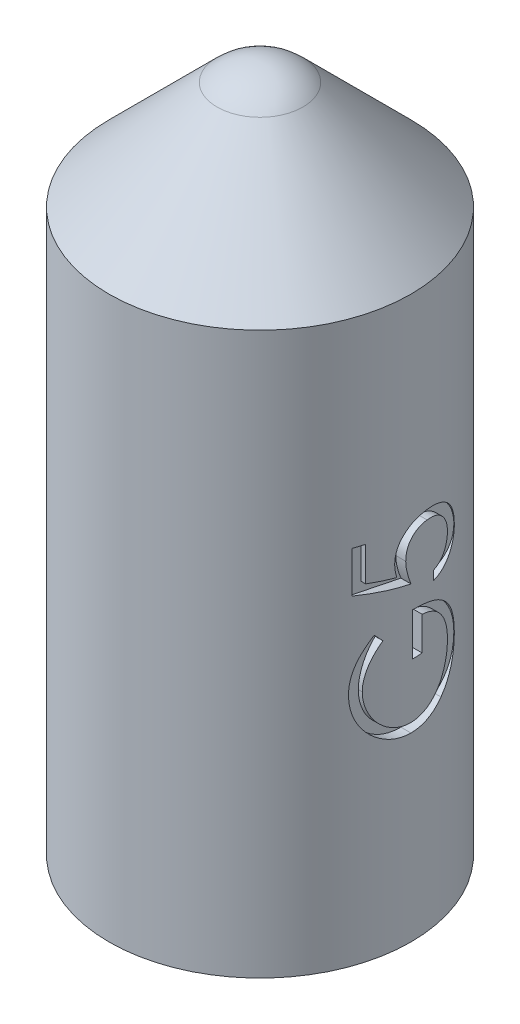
from build123d import *
from build123d.topology import SkipClean

# Parameters (mm, degrees)
ENL_V_MAT_EXTRU_1_DEPTH      = 0.1
ENL_V_MAT_EXTRU_2_REACH      = 9.762
ENL_V_MAT_EXTRU_2_END_RADIUS = 1.4


with BuildPart() as part:
    # Esquisse1 → R_volution1 (revolve)
    with BuildSketch(Plane.XY):
        with BuildLine():
            Line((-1.5, 5.75), (-1.5, 0.17544468))
            ThreePointArc((-1.5, 0.17544468), (-0.755112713, 0.044010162), (0, 0))
            Line((0, 0), (0, 7))
            ThreePointArc((0, 7), (-0.230969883, 6.954057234), (-0.426776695, 6.823223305))
            Line((-0.426776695, 6.823223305), (-1.5, 5.75))
        make_face()
    revolve(axis=Axis((0, 0, 0), (0, 1, 0)))

    # Esquisse2 → Enl_v. mat.-Extru.1 (cut)
    with BuildSketch(Plane(origin=(1.5, 0, 0), x_dir=(0, 0, -1), z_dir=(1, 0, 0))):
        with BuildLine():
            Line((-0.5, 3.769245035), (-0.397435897, 3.769245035))
            Line((-0.397435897, 3.769245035), (-0.397435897, 3.429100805))
            Line((-0.397435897, 3.429100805), (-0.134415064, 3.375214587))
            add(Edge.make_bspline(
                [(-0.134415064, 3.375214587), (-0.137337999, 3.385801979), (-0.143000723, 3.406313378), (-0.149288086, 3.436587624), (-0.153078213, 3.465328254), (-0.15359573, 3.48397836), (-0.153846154, 3.493003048)],
                knots=[0, 0, 0, 0, 1.100273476, 2.13160584, 3.095893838, 4, 4, 4, 4], degree=3))
            add(Edge.make_bspline(
                [(-0.153846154, 3.493003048), (-0.15361244, 3.504171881), (-0.1531529, 3.526132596), (-0.148478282, 3.558213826), (-0.141707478, 3.588993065), (-0.131275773, 3.61801586), (-0.118536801, 3.645741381), (-0.102491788, 3.671693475), (-0.083759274, 3.696236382), (-0.062435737, 3.719200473), (-0.038724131, 3.739935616), (-0.013123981, 3.757953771), (0.013806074, 3.773680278), (0.042697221, 3.785945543), (0.073004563, 3.795955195), (0.105077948, 3.802555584), (0.138632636, 3.806964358), (0.161577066, 3.807455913), (0.173277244, 3.807706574)],
                knots=[0, 0, 0, 0, 1.052805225, 2.070078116, 3.052532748, 4.020689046, 4.973125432, 5.925915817, 6.89216474, 7.881560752, 8.877013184, 9.857446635, 10.830895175, 11.812622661, 12.812548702, 13.836681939, 14.896847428, 16, 16, 16, 16], degree=3))
            add(Edge.make_bspline(
                [(0.173277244, 3.807706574), (0.181426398, 3.807516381), (0.19761458, 3.807138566), (0.221656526, 3.805221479), (0.245185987, 3.801516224), (0.268159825, 3.796601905), (0.290599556, 3.790041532), (0.31263082, 3.782367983), (0.334012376, 3.772830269), (0.354838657, 3.762256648), (0.374871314, 3.750548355), (0.393630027, 3.73738264), (0.411542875, 3.723702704), (0.428077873, 3.708754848), (0.443299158, 3.692709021), (0.457281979, 3.675654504), (0.470277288, 3.657745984), (0.48175374, 3.638701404), (0.492314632, 3.61894647), (0.500978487, 3.598195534), (0.508724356, 3.576921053), (0.514898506, 3.554816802), (0.519736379, 3.531932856), (0.523022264, 3.508231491), (0.525415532, 3.483837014), (0.525565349, 3.467301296), (0.525641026, 3.458948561)],
                knots=[0, 0, 0, 0, 1.056393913, 2.098511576, 3.122979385, 4.141471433, 5.141222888, 6.151259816, 7.162667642, 8.172852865, 9.177685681, 10.166741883, 11.141342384, 12.097242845, 13.052202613, 14.005160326, 14.953864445, 15.917140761, 16.884916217, 17.854238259, 18.828761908, 19.81781811, 20.826036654, 21.857789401, 22.917898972, 24, 24, 24, 24], degree=3))
            add(Edge.make_bspline(
                [(0.525641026, 3.458948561), (0.525443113, 3.448984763), (0.525053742, 3.429382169), (0.520998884, 3.400658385), (0.51515299, 3.373038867), (0.50649198, 3.346641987), (0.495151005, 3.321577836), (0.481676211, 3.297487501), (0.465634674, 3.27466957), (0.447173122, 3.253280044), (0.426887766, 3.233618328), (0.405084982, 3.215788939), (0.381737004, 3.200113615), (0.356919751, 3.186535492), (0.330677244, 3.174968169), (0.302928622, 3.165877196), (0.273814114, 3.158540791), (0.253770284, 3.15543692), (0.243589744, 3.15386042)],
                knots=[0, 0, 0, 0, 1.046872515, 2.059598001, 3.044168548, 4.012104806, 4.973680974, 5.932408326, 6.910122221, 7.900780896, 8.89867654, 9.876692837, 10.858029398, 11.85084981, 12.847361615, 13.868568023, 14.917415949, 16, 16, 16, 16], degree=3))
            Line((0.243589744, 3.15386042), (0.243589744, 3.24360401))
            add(Edge.make_bspline(
                [(0.243589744, 3.24360401), (0.253126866, 3.245810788), (0.271457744, 3.250052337), (0.297196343, 3.259386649), (0.32014068, 3.270688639), (0.34043104, 3.284441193), (0.358438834, 3.300382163), (0.374316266, 3.318912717), (0.388657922, 3.339569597), (0.400632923, 3.362535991), (0.410720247, 3.38681258), (0.417918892, 3.412076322), (0.422276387, 3.437963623), (0.422809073, 3.455392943), (0.423076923, 3.464156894)],
                knots=[0, 0, 0, 0, 1.13623081, 2.183898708, 3.172478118, 4.09966615, 5.022692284, 5.957376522, 6.927682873, 7.937366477, 8.960015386, 9.976409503, 10.982481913, 12, 12, 12, 12], degree=3))
            add(Edge.make_bspline(
                [(0.423076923, 3.464156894), (0.422840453, 3.472715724), (0.422374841, 3.489568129), (0.418848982, 3.514381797), (0.413276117, 3.538268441), (0.405468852, 3.561270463), (0.395140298, 3.583274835), (0.382452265, 3.604250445), (0.367721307, 3.62449611), (0.35088436, 3.643478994), (0.332319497, 3.660860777), (0.312469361, 3.676219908), (0.291292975, 3.689013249), (0.269157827, 3.69979444), (0.245821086, 3.707981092), (0.221392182, 3.713821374), (0.195810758, 3.717250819), (0.178362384, 3.717722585), (0.169471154, 3.717962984)],
                knots=[0, 0, 0, 0, 1.027268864, 2.022700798, 3.002744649, 3.968653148, 4.933396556, 5.915045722, 6.907600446, 7.935526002, 8.956456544, 9.95700807, 10.942805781, 11.92166854, 12.907987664, 13.905483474, 14.932689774, 16, 16, 16, 16], degree=3))
            add(Edge.make_bspline(
                [(0.169471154, 3.717962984), (0.161448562, 3.717780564), (0.145811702, 3.717425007), (0.122854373, 3.714346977), (0.101097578, 3.709205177), (0.080446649, 3.701884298), (0.060967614, 3.692747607), (0.042703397, 3.681276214), (0.025482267, 3.667958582), (0.009747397, 3.652410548), (-0.004798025, 3.635497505), (-0.017152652, 3.616785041), (-0.027659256, 3.596772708), (-0.036267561, 3.575423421), (-0.043124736, 3.552710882), (-0.047863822, 3.528622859), (-0.05069962, 3.50315386), (-0.05108431, 3.485732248), (-0.051282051, 3.476777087)],
                knots=[0, 0, 0, 0, 1.045723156, 2.038222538, 3.013889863, 3.95567481, 4.890389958, 5.81331128, 6.76251276, 7.723027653, 8.692928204, 9.666105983, 10.639751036, 11.635719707, 12.66315958, 13.728667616, 14.832476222, 16, 16, 16, 16], degree=3))
            add(Edge.make_bspline(
                [(-0.051282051, 3.476777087), (-0.051116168, 3.469025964), (-0.050773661, 3.453021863), (-0.048251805, 3.428472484), (-0.044183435, 3.402674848), (-0.038587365, 3.37572785), (-0.0312642, 3.347550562), (-0.022488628, 3.318202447), (-0.011996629, 3.2876218), (-0.004073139, 3.267016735), (0, 3.256424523)],
                knots=[0, 0, 0, 0, 0.817624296, 1.688186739, 2.600797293, 3.572016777, 4.590301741, 5.671205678, 6.80286297, 8, 8, 8, 8], degree=3))
            Line((0, 3.256424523), (-0.5, 3.358988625))
            Line((-0.5, 3.358988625), (-0.5, 3.769245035))
        make_face()
        with BuildLine():
            Line((-0.329326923, 2.961552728), (-0.256410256, 2.884629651))
            add(Edge.make_bspline(
                [(-0.256410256, 2.884629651), (-0.269509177, 2.870712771), (-0.295394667, 2.843210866), (-0.328926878, 2.798296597), (-0.357936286, 2.751623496), (-0.381363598, 2.703116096), (-0.399741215, 2.654046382), (-0.413100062, 2.60525811), (-0.421560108, 2.557067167), (-0.422576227, 2.525020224), (-0.423076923, 2.50922901)],
                knots=[0, 0, 0, 0, 1.089067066, 2.152164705, 3.18986567, 4.218445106, 5.218487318, 6.173592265, 7.100032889, 8, 8, 8, 8], degree=3))
            add(Edge.make_bspline(
                [(-0.423076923, 2.50922901), (-0.42295875, 2.499539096), (-0.42272271, 2.480184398), (-0.419710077, 2.451435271), (-0.415377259, 2.422987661), (-0.409108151, 2.394895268), (-0.401162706, 2.367103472), (-0.391224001, 2.339708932), (-0.379636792, 2.31266054), (-0.3662475, 2.286213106), (-0.351539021, 2.260572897), (-0.335239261, 2.236356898), (-0.317871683, 2.213409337), (-0.298997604, 2.192166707), (-0.278802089, 2.172487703), (-0.257648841, 2.15401036), (-0.235121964, 2.137079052), (-0.211314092, 2.12199744), (-0.186779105, 2.108378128), (-0.161725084, 2.096608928), (-0.136384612, 2.086377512), (-0.11056688, 2.078584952), (-0.084538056, 2.071984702), (-0.058161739, 2.067390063), (-0.031369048, 2.064791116), (-0.013426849, 2.064342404), (-0.004407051, 2.06411683)],
                knots=[0, 0, 0, 0, 1.028150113, 2.053633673, 3.06513288, 4.081487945, 5.106702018, 6.131327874, 7.172780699, 8.228344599, 9.276313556, 10.308389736, 11.324843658, 12.329040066, 13.321460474, 14.316307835, 15.308626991, 16.309440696, 17.305625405, 18.28535951, 19.246194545, 20.203493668, 21.145557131, 22.095268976, 23.042464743, 24, 24, 24, 24], degree=3))
            add(Edge.make_bspline(
                [(-0.004407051, 2.06411683), (0.004813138, 2.064332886), (0.023228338, 2.064764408), (0.050713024, 2.067522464), (0.077786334, 2.072652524), (0.104490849, 2.079455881), (0.130879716, 2.088105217), (0.156925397, 2.098731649), (0.18262536, 2.111390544), (0.207724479, 2.126010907), (0.232153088, 2.142156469), (0.255356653, 2.15991395), (0.277065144, 2.179313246), (0.297595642, 2.199998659), (0.316818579, 2.222158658), (0.334502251, 2.246008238), (0.350920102, 2.27121355), (0.365891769, 2.297785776), (0.379265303, 2.325444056), (0.391157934, 2.353803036), (0.400952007, 2.382953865), (0.408934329, 2.412743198), (0.415477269, 2.443135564), (0.41968655, 2.474285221), (0.422741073, 2.505963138), (0.422964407, 2.527317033), (0.423076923, 2.538075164)],
                knots=[0, 0, 0, 0, 0.935915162, 1.869274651, 2.799799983, 3.730201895, 4.664668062, 5.616159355, 6.583070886, 7.570012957, 8.562524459, 9.553461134, 10.53281078, 11.515274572, 12.509912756, 13.507571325, 14.526460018, 15.561318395, 16.601025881, 17.643204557, 18.680545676, 19.719612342, 20.772381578, 21.833430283, 22.908478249, 24, 24, 24, 24], degree=3))
            add(Edge.make_bspline(
                [(0.423076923, 2.538075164), (0.422806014, 2.551040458), (0.422274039, 2.576499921), (0.418129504, 2.61392387), (0.411664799, 2.649870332), (0.402167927, 2.684222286), (0.390147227, 2.717104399), (0.375281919, 2.748395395), (0.357728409, 2.778181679), (0.337842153, 2.806334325), (0.315685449, 2.832184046), (0.291989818, 2.855710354), (0.266448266, 2.876104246), (0.239441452, 2.893974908), (0.21071105, 2.908745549), (0.180416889, 2.920872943), (0.148540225, 2.93016793), (0.126514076, 2.93398367), (0.115384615, 2.935911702)],
                knots=[0, 0, 0, 0, 1.130199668, 2.219330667, 3.279027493, 4.311506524, 5.322739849, 6.327972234, 7.327472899, 8.33386792, 9.329086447, 10.29244429, 11.240784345, 12.174119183, 13.111530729, 14.052100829, 15.015757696, 16, 16, 16, 16], degree=3))
            Line((0.115384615, 2.935911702), (0.115384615, 2.602578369))
            Line((0.115384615, 2.602578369), (0.012820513, 2.602578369))
            Line((0.012820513, 2.602578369), (0.012820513, 3.025655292))
            add(Edge.make_bspline(
                [(0.012820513, 3.025655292), (0.031936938, 3.025167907), (0.069351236, 3.024214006), (0.12391417, 3.017522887), (0.17544894, 3.006718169), (0.224009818, 2.99195808), (0.269527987, 2.972850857), (0.312049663, 2.949601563), (0.351300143, 2.9218381), (0.387599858, 2.890549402), (0.419979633, 2.855435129), (0.448438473, 2.817444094), (0.472410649, 2.776513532), (0.491913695, 2.732682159), (0.507134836, 2.686093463), (0.517926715, 2.63663964), (0.524392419, 2.584387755), (0.525218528, 2.548577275), (0.525641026, 2.530262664)],
                knots=[0, 0, 0, 0, 1.140356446, 2.231883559, 3.274166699, 4.278491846, 5.25512956, 6.21435461, 7.1637429, 8.11826594, 9.068280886, 10.0076534, 10.945064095, 11.891975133, 12.864533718, 13.863980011, 14.907571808, 16, 16, 16, 16], degree=3))
            add(Edge.make_bspline(
                [(0.525641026, 2.530262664), (0.52547842, 2.518974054), (0.525157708, 2.496709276), (0.522878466, 2.463826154), (0.51936973, 2.431849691), (0.514071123, 2.400784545), (0.507581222, 2.370516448), (0.499270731, 2.341196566), (0.489651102, 2.312713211), (0.478709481, 2.285022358), (0.466031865, 2.258375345), (0.451943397, 2.232653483), (0.436516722, 2.20771459), (0.419485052, 2.183728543), (0.400975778, 2.160570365), (0.380951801, 2.138389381), (0.359474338, 2.117061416), (0.344223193, 2.103701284), (0.336538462, 2.096969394)],
                knots=[0, 0, 0, 0, 1.107784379, 2.184907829, 3.233506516, 4.263428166, 5.276301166, 6.270063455, 7.25232949, 8.225834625, 9.190232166, 10.146266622, 11.1027726, 12.066435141, 13.031522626, 14.010570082, 14.99756817, 16, 16, 16, 16], degree=3))
            add(Edge.make_bspline(
                [(0.336538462, 2.096969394), (0.324346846, 2.087201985), (0.300165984, 2.067829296), (0.261423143, 2.04289268), (0.221308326, 2.021635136), (0.179709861, 2.004387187), (0.136666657, 1.990919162), (0.092233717, 1.981260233), (0.046353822, 1.975601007), (0.015306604, 1.974785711), (-0.000400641, 1.974373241)],
                knots=[0, 0, 0, 0, 1.023165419, 2.029347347, 3.013907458, 3.994755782, 4.975994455, 5.96558838, 6.970761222, 8, 8, 8, 8], degree=3))
            add(Edge.make_bspline(
                [(-0.000400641, 1.974373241), (-0.012162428, 1.974525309), (-0.035536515, 1.974827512), (-0.070238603, 1.978491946), (-0.104324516, 1.983749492), (-0.137766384, 1.991477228), (-0.170586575, 2.001218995), (-0.202800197, 2.013377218), (-0.234426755, 2.027532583), (-0.265246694, 2.043986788), (-0.294858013, 2.062292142), (-0.323115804, 2.082180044), (-0.349562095, 2.103803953), (-0.374258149, 2.127226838), (-0.397569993, 2.151976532), (-0.419010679, 2.178572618), (-0.438915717, 2.206612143), (-0.456902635, 2.236312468), (-0.473064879, 2.267204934), (-0.487232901, 2.299222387), (-0.498942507, 2.332353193), (-0.508877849, 2.366349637), (-0.516225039, 2.401468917), (-0.52155325, 2.437456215), (-0.525199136, 2.474499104), (-0.525492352, 2.499537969), (-0.525641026, 2.512233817)],
                knots=[0, 0, 0, 0, 1.00895651, 2.005089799, 2.991467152, 3.967318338, 4.948153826, 5.927364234, 6.919980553, 7.91976625, 8.923240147, 9.905815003, 10.88314567, 11.851989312, 12.825009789, 13.798721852, 14.781296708, 15.773896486, 16.776076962, 17.771600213, 18.775744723, 19.78957137, 20.808953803, 21.851964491, 22.910847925, 24, 24, 24, 24], degree=3))
            add(Edge.make_bspline(
                [(-0.525641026, 2.512233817), (-0.525475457, 2.522587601), (-0.525147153, 2.543117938), (-0.522871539, 2.573668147), (-0.519264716, 2.603746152), (-0.514342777, 2.633396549), (-0.507638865, 2.662518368), (-0.499616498, 2.691194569), (-0.490275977, 2.719466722), (-0.479136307, 2.747246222), (-0.466492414, 2.774719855), (-0.452260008, 2.802040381), (-0.436195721, 2.829114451), (-0.418251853, 2.855989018), (-0.398736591, 2.882833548), (-0.377091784, 2.909223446), (-0.354170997, 2.935795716), (-0.337690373, 2.952881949), (-0.329326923, 2.961552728)],
                knots=[0, 0, 0, 0, 0.985871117, 1.954866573, 2.915460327, 3.869826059, 4.81536089, 5.759505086, 6.70452669, 7.649098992, 8.607881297, 9.583363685, 10.581137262, 11.603961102, 12.659522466, 13.73993555, 14.853081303, 16, 16, 16, 16], degree=3))
        make_face()
    extrude(amount=-ENL_V_MAT_EXTRU_1_DEPTH, mode=Mode.SUBTRACT)

    # Enl_v. mat.-Extru.2: up to this cylinder (the profile starts outside it)
    with SkipClean():  # the faces are left unmerged after this step: merging them gives an invalid solid
        enl_v_mat_extru_2_end = Plane(origin=(0, 3.3251495, 0), z_dir=(0, -1, 0)) * Cylinder(ENL_V_MAT_EXTRU_2_END_RADIUS, 24.168219, mode=Mode.PRIVATE)
        # Esquisse3 → Enl_v. mat.-Extru.2 (cut, up to the surface)
        with BuildSketch(Plane.ZY.offset(1.5), mode=Mode.PRIVATE) as enl_v_mat_extru_2_sk1:
            with BuildLine():
                Line((-0.5, 3.759421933), (-0.397435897, 3.759421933))
                Line((-0.397435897, 3.759421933), (-0.397435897, 3.419277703))
                Line((-0.397435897, 3.419277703), (-0.134415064, 3.365391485))
                add(Edge.make_bspline(
                    [(-0.134415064, 3.365391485), (-0.137337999, 3.375978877), (-0.143000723, 3.396490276), (-0.149288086, 3.426764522), (-0.153078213, 3.455505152), (-0.15359573, 3.474155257), (-0.153846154, 3.483179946)],
                    knots=[0, 0, 0, 0, 1.100273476, 2.13160584, 3.095893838, 4, 4, 4, 4], degree=3))
                add(Edge.make_bspline(
                    [(-0.153846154, 3.483179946), (-0.15361244, 3.494348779), (-0.1531529, 3.516309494), (-0.148478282, 3.548390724), (-0.141707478, 3.579169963), (-0.131275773, 3.608192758), (-0.118536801, 3.635918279), (-0.102491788, 3.661870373), (-0.083759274, 3.68641328), (-0.062435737, 3.709377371), (-0.038724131, 3.730112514), (-0.013123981, 3.748130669), (0.013806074, 3.763857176), (0.042697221, 3.77612244), (0.073004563, 3.786132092), (0.105077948, 3.792732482), (0.138632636, 3.797141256), (0.161577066, 3.797632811), (0.173277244, 3.797883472)],
                    knots=[0, 0, 0, 0, 1.052805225, 2.070078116, 3.052532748, 4.020689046, 4.973125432, 5.925915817, 6.89216474, 7.881560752, 8.877013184, 9.857446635, 10.830895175, 11.812622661, 12.812548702, 13.836681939, 14.896847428, 16, 16, 16, 16], degree=3))
                add(Edge.make_bspline(
                    [(0.173277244, 3.797883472), (0.181426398, 3.797693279), (0.19761458, 3.797315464), (0.221656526, 3.795398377), (0.245185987, 3.791693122), (0.268159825, 3.786778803), (0.290599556, 3.780218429), (0.31263082, 3.77254488), (0.334012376, 3.763007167), (0.354838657, 3.752433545), (0.374871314, 3.740725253), (0.393630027, 3.727559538), (0.411542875, 3.713879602), (0.428077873, 3.698931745), (0.443299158, 3.682885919), (0.457281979, 3.665831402), (0.470277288, 3.647922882), (0.48175374, 3.628878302), (0.492314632, 3.609123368), (0.500978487, 3.588372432), (0.508724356, 3.567097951), (0.514898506, 3.5449937), (0.519736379, 3.522109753), (0.523022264, 3.498408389), (0.525415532, 3.474013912), (0.525565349, 3.457478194), (0.525641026, 3.449125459)],
                    knots=[0, 0, 0, 0, 1.056393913, 2.098511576, 3.122979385, 4.141471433, 5.141222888, 6.151259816, 7.162667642, 8.172852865, 9.177685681, 10.166741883, 11.141342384, 12.097242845, 13.052202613, 14.005160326, 14.953864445, 15.917140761, 16.884916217, 17.854238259, 18.828761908, 19.81781811, 20.826036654, 21.857789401, 22.917898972, 24, 24, 24, 24], degree=3))
                add(Edge.make_bspline(
                    [(0.525641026, 3.449125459), (0.525443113, 3.439161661), (0.525053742, 3.419559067), (0.520998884, 3.390835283), (0.51515299, 3.363215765), (0.50649198, 3.336818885), (0.495151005, 3.311754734), (0.481676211, 3.287664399), (0.465634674, 3.264846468), (0.447173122, 3.243456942), (0.426887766, 3.223795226), (0.405084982, 3.205965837), (0.381737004, 3.190290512), (0.356919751, 3.17671239), (0.330677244, 3.165145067), (0.302928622, 3.156054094), (0.273814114, 3.148717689), (0.253770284, 3.145613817), (0.243589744, 3.144037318)],
                    knots=[0, 0, 0, 0, 1.046872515, 2.059598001, 3.044168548, 4.012104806, 4.973680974, 5.932408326, 6.910122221, 7.900780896, 8.89867654, 9.876692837, 10.858029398, 11.85084981, 12.847361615, 13.868568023, 14.917415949, 16, 16, 16, 16], degree=3))
                Line((0.243589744, 3.144037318), (0.243589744, 3.233780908))
                add(Edge.make_bspline(
                    [(0.243589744, 3.233780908), (0.253126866, 3.235987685), (0.271457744, 3.240229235), (0.297196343, 3.249563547), (0.32014068, 3.260865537), (0.34043104, 3.27461809), (0.358438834, 3.290559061), (0.374316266, 3.309089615), (0.388657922, 3.329746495), (0.400632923, 3.352712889), (0.410720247, 3.376989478), (0.417918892, 3.40225322), (0.422276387, 3.428140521), (0.422809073, 3.445569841), (0.423076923, 3.454333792)],
                    knots=[0, 0, 0, 0, 1.13623081, 2.183898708, 3.172478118, 4.09966615, 5.022692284, 5.957376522, 6.927682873, 7.937366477, 8.960015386, 9.976409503, 10.982481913, 12, 12, 12, 12], degree=3))
                add(Edge.make_bspline(
                    [(0.423076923, 3.454333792), (0.422840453, 3.462892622), (0.422374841, 3.479745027), (0.418848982, 3.504558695), (0.413276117, 3.528445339), (0.405468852, 3.551447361), (0.395140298, 3.573451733), (0.382452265, 3.594427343), (0.367721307, 3.614673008), (0.35088436, 3.633655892), (0.332319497, 3.651037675), (0.312469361, 3.666396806), (0.291292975, 3.679190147), (0.269157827, 3.689971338), (0.245821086, 3.69815799), (0.221392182, 3.703998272), (0.195810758, 3.707427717), (0.178362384, 3.707899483), (0.169471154, 3.708139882)],
                    knots=[0, 0, 0, 0, 1.027268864, 2.022700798, 3.002744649, 3.968653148, 4.933396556, 5.915045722, 6.907600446, 7.935526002, 8.956456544, 9.95700807, 10.942805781, 11.92166854, 12.907987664, 13.905483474, 14.932689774, 16, 16, 16, 16], degree=3))
                add(Edge.make_bspline(
                    [(0.169471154, 3.708139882), (0.161448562, 3.707957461), (0.145811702, 3.707601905), (0.122854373, 3.704523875), (0.101097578, 3.699382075), (0.080446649, 3.692061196), (0.060967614, 3.682924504), (0.042703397, 3.671453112), (0.025482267, 3.658135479), (0.009747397, 3.642587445), (-0.004798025, 3.625674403), (-0.017152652, 3.606961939), (-0.027659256, 3.586949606), (-0.036267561, 3.565600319), (-0.043124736, 3.54288778), (-0.047863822, 3.518799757), (-0.05069962, 3.493330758), (-0.05108431, 3.475909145), (-0.051282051, 3.466953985)],
                    knots=[0, 0, 0, 0, 1.045723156, 2.038222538, 3.013889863, 3.95567481, 4.890389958, 5.81331128, 6.76251276, 7.723027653, 8.692928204, 9.666105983, 10.639751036, 11.635719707, 12.66315958, 13.728667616, 14.832476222, 16, 16, 16, 16], degree=3))
                add(Edge.make_bspline(
                    [(-0.051282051, 3.466953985), (-0.051116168, 3.459202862), (-0.050773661, 3.443198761), (-0.048251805, 3.418649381), (-0.044183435, 3.392851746), (-0.038587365, 3.365904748), (-0.0312642, 3.33772746), (-0.022488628, 3.308379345), (-0.011996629, 3.277798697), (-0.004073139, 3.257193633), (0, 3.24660142)],
                    knots=[0, 0, 0, 0, 0.817624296, 1.688186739, 2.600797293, 3.572016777, 4.590301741, 5.671205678, 6.80286297, 8, 8, 8, 8], degree=3))
                Line((0, 3.24660142), (-0.5, 3.349165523))
                Line((-0.5, 3.349165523), (-0.5, 3.759421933))
            make_face()
        enl_v_mat_extru_2_tool1 = extrude(enl_v_mat_extru_2_sk1.sketch, amount=-ENL_V_MAT_EXTRU_2_REACH, mode=Mode.PRIVATE) - enl_v_mat_extru_2_end
        add(enl_v_mat_extru_2_tool1.solids().sort_by_distance((-1.5, 3.747259, -0.448718))[0], mode=Mode.SUBTRACT)
        # Esquisse3 → Enl_v. mat.-Extru.2 (cut, up to the surface)
        with BuildSketch(Plane.ZY.offset(1.5), mode=Mode.PRIVATE) as enl_v_mat_extru_2_sk2:
            with BuildLine():
                Line((-0.329326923, 2.951729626), (-0.256410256, 2.874806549))
                add(Edge.make_bspline(
                    [(-0.256410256, 2.874806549), (-0.269509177, 2.860889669), (-0.295394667, 2.833387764), (-0.328926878, 2.788473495), (-0.357936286, 2.741800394), (-0.381363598, 2.693292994), (-0.399741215, 2.64422328), (-0.413100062, 2.595435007), (-0.421560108, 2.547244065), (-0.422576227, 2.515197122), (-0.423076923, 2.499405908)],
                    knots=[0, 0, 0, 0, 1.089067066, 2.152164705, 3.18986567, 4.218445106, 5.218487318, 6.173592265, 7.100032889, 8, 8, 8, 8], degree=3))
                add(Edge.make_bspline(
                    [(-0.423076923, 2.499405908), (-0.42295875, 2.489715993), (-0.42272271, 2.470361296), (-0.419710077, 2.441612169), (-0.415377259, 2.413164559), (-0.409108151, 2.385072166), (-0.401162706, 2.357280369), (-0.391224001, 2.32988583), (-0.379636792, 2.302837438), (-0.3662475, 2.276390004), (-0.351539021, 2.250749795), (-0.335239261, 2.226533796), (-0.317871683, 2.203586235), (-0.298997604, 2.182343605), (-0.278802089, 2.162664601), (-0.257648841, 2.144187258), (-0.235121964, 2.12725595), (-0.211314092, 2.112174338), (-0.186779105, 2.098555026), (-0.161725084, 2.086785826), (-0.136384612, 2.07655441), (-0.11056688, 2.06876185), (-0.084538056, 2.0621616), (-0.058161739, 2.057566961), (-0.031369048, 2.054968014), (-0.013426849, 2.054519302), (-0.004407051, 2.054293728)],
                    knots=[0, 0, 0, 0, 1.028150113, 2.053633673, 3.06513288, 4.081487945, 5.106702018, 6.131327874, 7.172780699, 8.228344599, 9.276313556, 10.308389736, 11.324843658, 12.329040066, 13.321460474, 14.316307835, 15.308626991, 16.309440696, 17.305625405, 18.28535951, 19.246194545, 20.203493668, 21.145557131, 22.095268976, 23.042464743, 24, 24, 24, 24], degree=3))
                add(Edge.make_bspline(
                    [(-0.004407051, 2.054293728), (0.004813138, 2.054509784), (0.023228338, 2.054941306), (0.050713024, 2.057699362), (0.077786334, 2.062829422), (0.104490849, 2.069632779), (0.130879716, 2.078282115), (0.156925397, 2.088908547), (0.18262536, 2.101567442), (0.207724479, 2.116187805), (0.232153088, 2.132333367), (0.255356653, 2.150090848), (0.277065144, 2.169490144), (0.297595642, 2.190175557), (0.316818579, 2.212335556), (0.334502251, 2.236185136), (0.350920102, 2.261390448), (0.365891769, 2.287962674), (0.379265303, 2.315620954), (0.391157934, 2.343979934), (0.400952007, 2.373130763), (0.408934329, 2.402920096), (0.415477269, 2.433312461), (0.41968655, 2.464462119), (0.422741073, 2.496140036), (0.422964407, 2.517493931), (0.423076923, 2.528252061)],
                    knots=[0, 0, 0, 0, 0.935915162, 1.869274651, 2.799799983, 3.730201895, 4.664668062, 5.616159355, 6.583070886, 7.570012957, 8.562524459, 9.553461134, 10.53281078, 11.515274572, 12.509912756, 13.507571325, 14.526460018, 15.561318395, 16.601025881, 17.643204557, 18.680545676, 19.719612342, 20.772381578, 21.833430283, 22.908478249, 24, 24, 24, 24], degree=3))
                add(Edge.make_bspline(
                    [(0.423076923, 2.528252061), (0.422806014, 2.541217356), (0.422274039, 2.566676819), (0.418129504, 2.604100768), (0.411664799, 2.64004723), (0.402167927, 2.674399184), (0.390147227, 2.707281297), (0.375281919, 2.738572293), (0.357728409, 2.768358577), (0.337842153, 2.796511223), (0.315685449, 2.822360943), (0.291989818, 2.845887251), (0.266448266, 2.866281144), (0.239441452, 2.884151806), (0.21071105, 2.898922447), (0.180416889, 2.91104984), (0.148540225, 2.920344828), (0.126514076, 2.924160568), (0.115384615, 2.9260886)],
                    knots=[0, 0, 0, 0, 1.130199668, 2.219330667, 3.279027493, 4.311506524, 5.322739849, 6.327972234, 7.327472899, 8.33386792, 9.329086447, 10.29244429, 11.240784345, 12.174119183, 13.111530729, 14.052100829, 15.015757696, 16, 16, 16, 16], degree=3))
                Line((0.115384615, 2.9260886), (0.115384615, 2.592755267))
                Line((0.115384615, 2.592755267), (0.012820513, 2.592755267))
                Line((0.012820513, 2.592755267), (0.012820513, 3.01583219))
                add(Edge.make_bspline(
                    [(0.012820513, 3.01583219), (0.031936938, 3.015344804), (0.069351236, 3.014390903), (0.12391417, 3.007699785), (0.17544894, 2.996895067), (0.224009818, 2.982134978), (0.269527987, 2.963027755), (0.312049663, 2.939778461), (0.351300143, 2.912014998), (0.387599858, 2.8807263), (0.419979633, 2.845612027), (0.448438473, 2.807620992), (0.472410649, 2.76669043), (0.491913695, 2.722859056), (0.507134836, 2.676270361), (0.517926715, 2.626816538), (0.524392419, 2.574564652), (0.525218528, 2.538754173), (0.525641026, 2.520439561)],
                    knots=[0, 0, 0, 0, 1.140356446, 2.231883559, 3.274166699, 4.278491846, 5.25512956, 6.21435461, 7.1637429, 8.11826594, 9.068280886, 10.0076534, 10.945064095, 11.891975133, 12.864533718, 13.863980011, 14.907571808, 16, 16, 16, 16], degree=3))
                add(Edge.make_bspline(
                    [(0.525641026, 2.520439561), (0.52547842, 2.509150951), (0.525157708, 2.486886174), (0.522878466, 2.454003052), (0.51936973, 2.422026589), (0.514071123, 2.390961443), (0.507581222, 2.360693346), (0.499270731, 2.331373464), (0.489651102, 2.302890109), (0.478709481, 2.275199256), (0.466031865, 2.248552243), (0.451943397, 2.222830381), (0.436516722, 2.197891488), (0.419485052, 2.173905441), (0.400975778, 2.150747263), (0.380951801, 2.128566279), (0.359474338, 2.107238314), (0.344223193, 2.093878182), (0.336538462, 2.087146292)],
                    knots=[0, 0, 0, 0, 1.107784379, 2.184907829, 3.233506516, 4.263428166, 5.276301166, 6.270063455, 7.25232949, 8.225834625, 9.190232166, 10.146266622, 11.1027726, 12.066435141, 13.031522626, 14.010570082, 14.99756817, 16, 16, 16, 16], degree=3))
                add(Edge.make_bspline(
                    [(0.336538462, 2.087146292), (0.324346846, 2.077378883), (0.300165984, 2.058006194), (0.261423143, 2.033069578), (0.221308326, 2.011812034), (0.179709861, 1.994564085), (0.136666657, 1.98109606), (0.092233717, 1.971437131), (0.046353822, 1.965777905), (0.015306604, 1.964962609), (-0.000400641, 1.964550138)],
                    knots=[0, 0, 0, 0, 1.023165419, 2.029347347, 3.013907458, 3.994755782, 4.975994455, 5.96558838, 6.970761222, 8, 8, 8, 8], degree=3))
                add(Edge.make_bspline(
                    [(-0.000400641, 1.964550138), (-0.012162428, 1.964702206), (-0.035536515, 1.96500441), (-0.070238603, 1.968668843), (-0.104324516, 1.97392639), (-0.137766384, 1.981654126), (-0.170586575, 1.991395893), (-0.202800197, 2.003554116), (-0.234426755, 2.017709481), (-0.265246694, 2.034163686), (-0.294858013, 2.05246904), (-0.323115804, 2.072356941), (-0.349562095, 2.093980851), (-0.374258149, 2.117403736), (-0.397569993, 2.14215343), (-0.419010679, 2.168749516), (-0.438915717, 2.19678904), (-0.456902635, 2.226489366), (-0.473064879, 2.257381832), (-0.487232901, 2.289399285), (-0.498942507, 2.32253009), (-0.508877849, 2.356526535), (-0.516225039, 2.391645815), (-0.52155325, 2.427633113), (-0.525199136, 2.464676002), (-0.525492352, 2.489714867), (-0.525641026, 2.502410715)],
                    knots=[0, 0, 0, 0, 1.00895651, 2.005089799, 2.991467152, 3.967318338, 4.948153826, 5.927364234, 6.919980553, 7.91976625, 8.923240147, 9.905815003, 10.88314567, 11.851989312, 12.825009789, 13.798721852, 14.781296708, 15.773896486, 16.776076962, 17.771600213, 18.775744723, 19.78957137, 20.808953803, 21.851964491, 22.910847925, 24, 24, 24, 24], degree=3))
                add(Edge.make_bspline(
                    [(-0.525641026, 2.502410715), (-0.525475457, 2.512764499), (-0.525147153, 2.533294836), (-0.522871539, 2.563845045), (-0.519264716, 2.593923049), (-0.514342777, 2.623573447), (-0.507638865, 2.652695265), (-0.499616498, 2.681371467), (-0.490275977, 2.70964362), (-0.479136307, 2.73742312), (-0.466492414, 2.764896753), (-0.452260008, 2.792217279), (-0.436195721, 2.819291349), (-0.418251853, 2.846165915), (-0.398736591, 2.873010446), (-0.377091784, 2.899400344), (-0.354170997, 2.925972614), (-0.337690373, 2.943058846), (-0.329326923, 2.951729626)],
                    knots=[0, 0, 0, 0, 0.985871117, 1.954866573, 2.915460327, 3.869826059, 4.81536089, 5.759505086, 6.70452669, 7.649098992, 8.607881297, 9.583363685, 10.581137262, 11.603961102, 12.659522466, 13.73993555, 14.853081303, 16, 16, 16, 16], degree=3))
            make_face()
        enl_v_mat_extru_2_tool2 = extrude(enl_v_mat_extru_2_sk2.sketch, amount=-ENL_V_MAT_EXTRU_2_REACH, mode=Mode.PRIVATE) - enl_v_mat_extru_2_end
        add(enl_v_mat_extru_2_tool2.solids().sort_by_distance((-1.5, 2.90304, -0.303659))[0], mode=Mode.SUBTRACT)


solid = part.part
